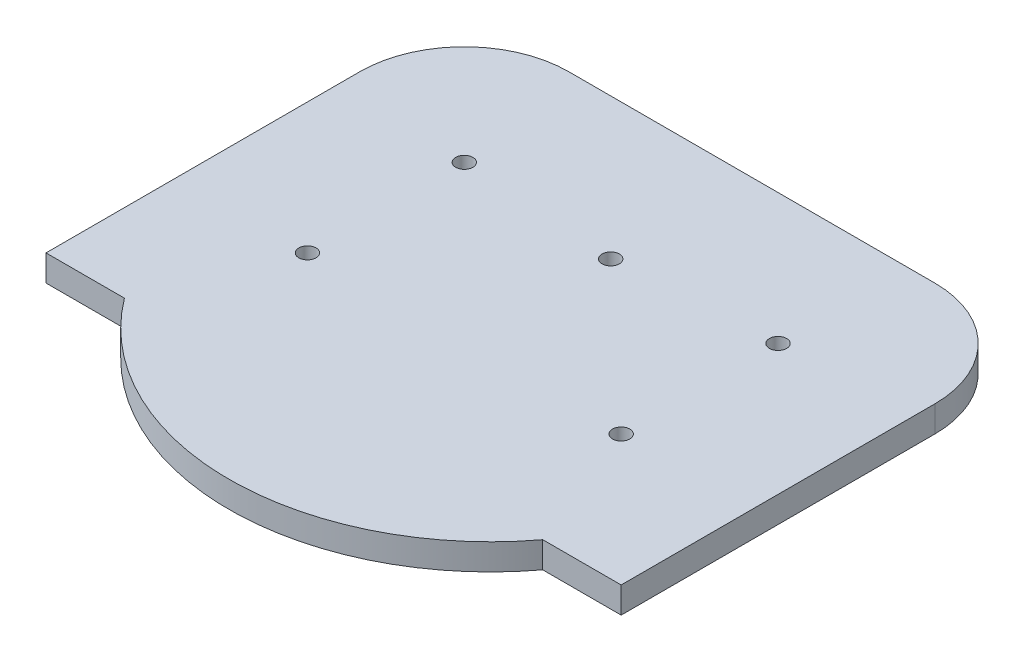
from build123d import *

# Parameters (mm, degrees)
EXTRUDE1_DEPTH    = 5
M4_TAPPED_HOLE1_D = 3.3


with BuildPart() as part:
    # Sketch1 → Extrude1 (new body)
    with BuildSketch(Plane(origin=(0, 0, 0), x_dir=(1, 0, 0), z_dir=(0, 1, 0))):
        with BuildLine():
            Line((0, 0), (15, 0))
            ThreePointArc((15, 0), (55, -20), (95, 0))
            Line((95, 0), (110, 0))
            Line((110, 0), (110, 60))
            ThreePointArc((110, 60), (104.142135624, 74.142135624), (90, 80))
            Line((90, 80), (20, 80))
            ThreePointArc((20, 80), (5.857864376, 74.142135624), (0, 60))
            Line((0, 60), (0, 0))
        make_face()
    extrude(amount=EXTRUDE1_DEPTH)

    # M4 Tapped Hole1 (through all)
    with Locations(Plane(origin=(25, 5, -55), x_dir=(0, 0, 1), z_dir=(0, 1, 0))):
        with Locations((0, 0), (2, 30), (0, 60), (30, 60), (30, 0)):
            Hole(M4_TAPPED_HOLE1_D / 2)


solid = part.part
